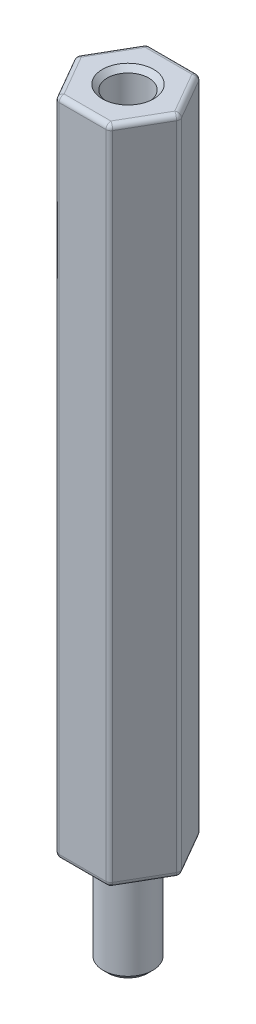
from build123d import *

# Parameters (mm, degrees)
SKETCH1_R           = 1.25
BOSS_EXTRUDE1_DEPTH = 40
FILLET1_R           = 0.3
FILLET2_R           = 0.3
SKETCH2_R           = 1.5
BOSS_EXTRUDE2_DEPTH = 6
CHAMFER1_SIZE       = 0.3
FILLET3_R           = 0.3


with BuildPart() as part:
    # Sketch1 → Boss-Extrude1 (new body)
    with BuildSketch(Plane(origin=(0, 0, 0), x_dir=(1, 0, 0), z_dir=(0, 1, 0))):
        Polygon((-1.58771324, 2.75), (-3.175426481, 0), (-1.58771324, -2.75), (1.58771324, -2.75), (3.175426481, 0), (1.58771324, 2.75), align=None)
        with Locations(Location((0, 0, 0), (0, 0, 270))):
            Circle(SKETCH1_R, mode=Mode.SUBTRACT)
    extrude(amount=BOSS_EXTRUDE1_DEPTH)

    # Fillet1
    fillet1_edges = [part.edges().sort_by_distance(p)[0] for p in [
        (1.58771324, 20, -2.75),
        (3.175426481, 20, 0),
        (1.58771324, 20, 2.75),
        (-1.58771324, 20, 2.75),
        (-3.175426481, 20, 0),
        (-1.58771324, 20, -2.75),
    ]]
    fillet(fillet1_edges, radius=FILLET1_R)

    # Fillet2
    fillet2_edges = [part.edges().sort_by_distance(p)[0] for p in [
        (0, 0, -2.75),
        (0, 40, -2.75),
        (2.38156986, 0, -1.375),
        (2.38156986, 0, 1.375),
        (0, 0, 2.75),
        (-2.38156986, 0, 1.375),
        (-2.38156986, 0, -1.375),
        (1.56450816, 0, 2.709807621),
        (-1.56450816, 0, 2.709807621),
        (-3.129016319, 0, 0),
        (-1.56450816, 0, -2.709807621),
        (3.129016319, 0, 0),
        (1.56450816, 0, -2.709807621),
        (2.38156986, 40, -1.375),
        (-2.38156986, 40, -1.375),
        (-2.38156986, 40, 1.375),
        (0, 40, 2.75),
        (2.38156986, 40, 1.375),
        (1.56450816, 40, 2.709807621),
        (-1.56450816, 40, 2.709807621),
        (-3.129016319, 40, 0),
        (-1.56450816, 40, -2.709807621),
        (3.129016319, 40, 0),
        (1.56450816, 40, -2.709807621),
    ]]
    fillet(fillet2_edges, radius=FILLET2_R)

    # Sketch2 → Boss-Extrude2 (add)
    with BuildSketch(Plane.XZ):
        with Locations(Location((0, 0, 0), (0, 0, 90))):
            Circle(SKETCH2_R)
    extrude(amount=BOSS_EXTRUDE2_DEPTH)

    # Chamfer1
    chamfer1_edges = [part.edges().sort_by_distance(p)[0] for p in [
        (0, -6, -1.5),
        (0, 40, -1.25),
    ]]
    chamfer(chamfer1_edges, length=CHAMFER1_SIZE)

    # Fillet3
    fillet3_edges = [part.edges().sort_by_distance(p)[0] for p in [
        (0, 0, -1.5),
    ]]
    fillet(fillet3_edges, radius=FILLET3_R)


solid = part.part
